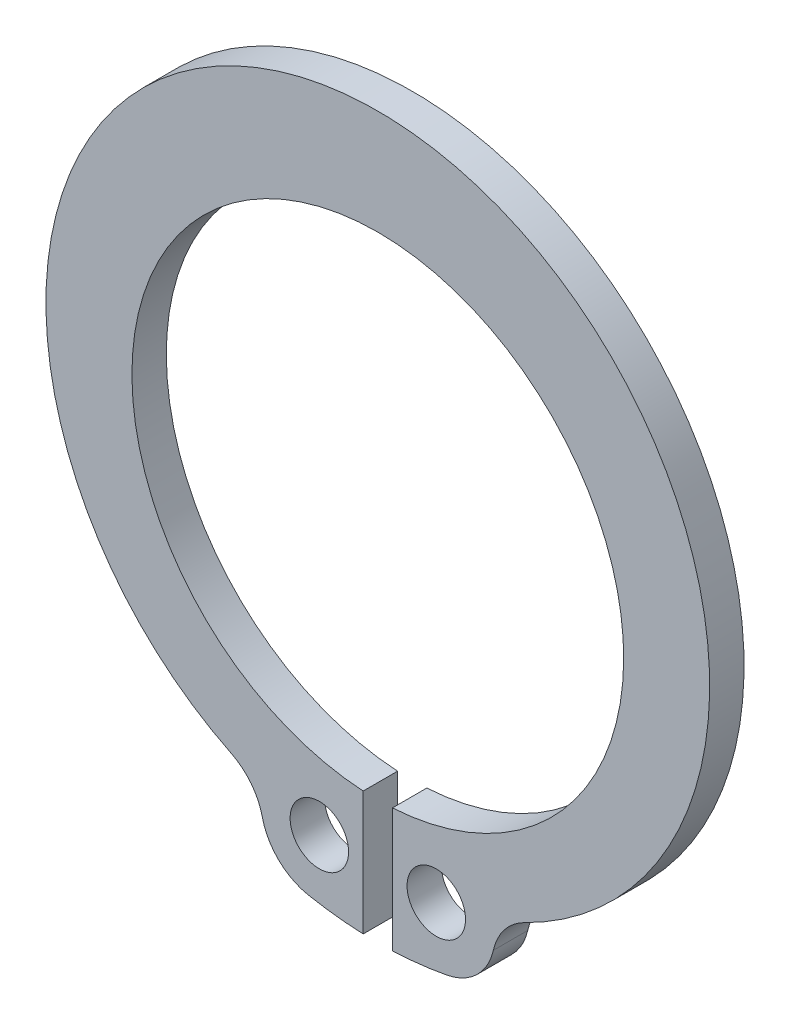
ISO-10303-21;
HEADER;
FILE_DESCRIPTION(('STEP AP214'),'2;1');
FILE_NAME('part.step','',(''),(''),'','','');
FILE_SCHEMA(('AUTOMOTIVE_DESIGN { 1 0 10303 214 1 1 1 1 }'));
ENDSEC;
DATA;
#1=APPLICATION_CONTEXT('core data for automotive mechanical design processes');
#2=APPLICATION_PROTOCOL_DEFINITION('international standard','automotive_design',2000,#1);
#3=PRODUCT_CONTEXT('',#1,'mechanical');
#4=PRODUCT('Part','Part','',(#3));
#5=PRODUCT_RELATED_PRODUCT_CATEGORY('part','',(#4));
#6=PRODUCT_DEFINITION_FORMATION('','',#4);
#7=PRODUCT_DEFINITION_CONTEXT('part definition',#1,'design');
#8=PRODUCT_DEFINITION('design','',#6,#7);
#9=PRODUCT_DEFINITION_SHAPE('','',#8);
#10=(LENGTH_UNIT() NAMED_UNIT(*) SI_UNIT(.MILLI.,.METRE.));
#11=(NAMED_UNIT(*) PLANE_ANGLE_UNIT() SI_UNIT($,.RADIAN.));
#12=(NAMED_UNIT(*) SI_UNIT($,.STERADIAN.) SOLID_ANGLE_UNIT());
#13=UNCERTAINTY_MEASURE_WITH_UNIT(LENGTH_MEASURE(1.E-05),#10,'distance_accuracy_value','');
#14=(GEOMETRIC_REPRESENTATION_CONTEXT(3) GLOBAL_UNCERTAINTY_ASSIGNED_CONTEXT((#13)) GLOBAL_UNIT_ASSIGNED_CONTEXT((#10,
#11,#12)) REPRESENTATION_CONTEXT('',''));
#15=CARTESIAN_POINT('',(0.,0.,0.));
#16=DIRECTION('',(0.,0.,1.));
#17=DIRECTION('',(1.,0.,0.));
#18=AXIS2_PLACEMENT_3D('',#15,#16,#17);
#19=CARTESIAN_POINT('',(0.,-9.11937544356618,1.));
#20=DIRECTION('',(0.,0.,1.));
#21=DIRECTION('',(1.,0.,0.));
#22=AXIS2_PLACEMENT_3D('',#19,#20,#21);
#23=PLANE('',#22);
#24=CARTESIAN_POINT('',(0.,-7.45,1.));
#25=DIRECTION('',(0.,0.,1.));
#26=DIRECTION('',(1.,0.,0.));
#27=AXIS2_PLACEMENT_3D('',#24,#25,#26);
#28=CIRCLE('',#27,9.64999999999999);
#29=CARTESIAN_POINT('',(-4.26561529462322,-16.1060398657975,1.));
#30=VERTEX_POINT('',#29);
#31=CARTESIAN_POINT('',(4.26561529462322,-16.1060398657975,1.));
#32=VERTEX_POINT('',#31);
#33=EDGE_CURVE('E127',#30,#32,#28,.F.);
#34=ORIENTED_EDGE('',*,*,#33,.F.);
#35=CARTESIAN_POINT('',(-5.01707083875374,-17.6309380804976,1.));
#36=DIRECTION('',(0.,0.,1.));
#37=DIRECTION('',(1.,0.,0.));
#38=AXIS2_PLACEMENT_3D('',#35,#36,#37);
#39=CIRCLE('',#38,1.7);
#40=CARTESIAN_POINT('',(-3.35853541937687,-17.2577621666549,1.));
#41=VERTEX_POINT('',#40);
#42=EDGE_CURVE('E124',#41,#30,#39,.T.);
#43=ORIENTED_EDGE('',*,*,#42,.F.);
#44=CARTESIAN_POINT('',(-1.7,-16.8845862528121,1.));
#45=DIRECTION('',(0.,0.,1.));
#46=DIRECTION('',(1.,0.,0.));
#47=AXIS2_PLACEMENT_3D('',#44,#45,#46);
#48=CIRCLE('',#47,1.7);
#49=CARTESIAN_POINT('',(-2.01948650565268,-18.5542953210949,1.));
#50=VERTEX_POINT('',#49);
#51=EDGE_CURVE('E100',#50,#41,#48,.F.);
#52=ORIENTED_EDGE('',*,*,#51,.F.);
#53=CARTESIAN_POINT('',(0.,-8.,1.));
#54=DIRECTION('',(0.,0.,1.));
#55=DIRECTION('',(1.,0.,0.));
#56=AXIS2_PLACEMENT_3D('',#53,#54,#55);
#57=CIRCLE('',#56,10.7457654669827);
#58=CARTESIAN_POINT('',(-0.425000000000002,-18.7373577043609,1.));
#59=VERTEX_POINT('',#58);
#60=EDGE_CURVE('E21',#50,#59,#57,.T.);
#61=ORIENTED_EDGE('',*,*,#60,.T.);
#62=DIRECTION('',(0.,1.,0.));
#63=VECTOR('',#62,1.);
#64=CARTESIAN_POINT('',(-0.424999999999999,-15.1373577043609,1.));
#65=LINE('',#64,#63);
#66=CARTESIAN_POINT('',(-0.424999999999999,-15.1373577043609,1.));
#67=VERTEX_POINT('',#66);
#68=EDGE_CURVE('E97',#67,#59,#65,.F.);
#69=ORIENTED_EDGE('',*,*,#68,.F.);
#70=CARTESIAN_POINT('',(0.,-8.,1.));
#71=DIRECTION('',(0.,0.,1.));
#72=DIRECTION('',(1.,0.,0.));
#73=AXIS2_PLACEMENT_3D('',#70,#71,#72);
#74=CIRCLE('',#73,7.15);
#75=CARTESIAN_POINT('',(0.424999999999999,-15.1373577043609,1.));
#76=VERTEX_POINT('',#75);
#77=EDGE_CURVE('E108',#76,#67,#74,.T.);
#78=ORIENTED_EDGE('',*,*,#77,.F.);
#79=DIRECTION('',(0.,-1.,0.));
#80=VECTOR('',#79,1.);
#81=CARTESIAN_POINT('',(0.424999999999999,-18.7373577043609,1.));
#82=LINE('',#81,#80);
#83=CARTESIAN_POINT('',(0.425,-18.7373577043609,1.));
#84=VERTEX_POINT('',#83);
#85=EDGE_CURVE('E139',#84,#76,#82,.F.);
#86=ORIENTED_EDGE('',*,*,#85,.F.);
#87=CARTESIAN_POINT('',(0.,-8.,1.));
#88=DIRECTION('',(0.,0.,1.));
#89=DIRECTION('',(1.,0.,0.));
#90=AXIS2_PLACEMENT_3D('',#87,#88,#89);
#91=CIRCLE('',#90,10.7457654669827);
#92=CARTESIAN_POINT('',(2.01948650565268,-18.5542953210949,1.));
#93=VERTEX_POINT('',#92);
#94=EDGE_CURVE('E136',#93,#84,#91,.F.);
#95=ORIENTED_EDGE('',*,*,#94,.F.);
#96=CARTESIAN_POINT('',(1.7,-16.8845862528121,1.));
#97=DIRECTION('',(0.,0.,1.));
#98=DIRECTION('',(1.,0.,0.));
#99=AXIS2_PLACEMENT_3D('',#96,#97,#98);
#100=CIRCLE('',#99,1.7);
#101=CARTESIAN_POINT('',(3.35853541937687,-17.2577621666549,1.));
#102=VERTEX_POINT('',#101);
#103=EDGE_CURVE('E133',#102,#93,#100,.F.);
#104=ORIENTED_EDGE('',*,*,#103,.F.);
#105=CARTESIAN_POINT('',(5.01707083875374,-17.6309380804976,1.));
#106=DIRECTION('',(0.,0.,1.));
#107=DIRECTION('',(1.,0.,0.));
#108=AXIS2_PLACEMENT_3D('',#105,#106,#107);
#109=CIRCLE('',#108,1.7);
#110=EDGE_CURVE('E130',#32,#102,#109,.T.);
#111=ORIENTED_EDGE('',*,*,#110,.F.);
#112=EDGE_LOOP('',(#34,#43,#52,#61,#69,#78,#86,#95,#104,#111));
#113=FACE_BOUND('',#112,.T.);
#114=CARTESIAN_POINT('',(-1.7,-16.8845862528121,1.));
#115=DIRECTION('',(0.,0.,1.));
#116=DIRECTION('',(1.,0.,0.));
#117=AXIS2_PLACEMENT_3D('',#114,#115,#116);
#118=CIRCLE('',#117,0.85);
#119=CARTESIAN_POINT('',(-0.849999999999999,-16.8845862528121,1.));
#120=VERTEX_POINT('',#119);
#121=EDGE_CURVE('E109',#120,#120,#118,.F.);
#122=ORIENTED_EDGE('',*,*,#121,.T.);
#123=EDGE_LOOP('',(#122));
#124=FACE_BOUND('',#123,.T.);
#125=CARTESIAN_POINT('',(1.7,-16.8845862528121,1.));
#126=DIRECTION('',(0.,0.,1.));
#127=DIRECTION('',(1.,0.,0.));
#128=AXIS2_PLACEMENT_3D('',#125,#126,#127);
#129=CIRCLE('',#128,0.85);
#130=CARTESIAN_POINT('',(2.55,-16.8845862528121,1.));
#131=VERTEX_POINT('',#130);
#132=EDGE_CURVE('E101',#131,#131,#129,.F.);
#133=ORIENTED_EDGE('',*,*,#132,.T.);
#134=EDGE_LOOP('',(#133));
#135=FACE_BOUND('',#134,.T.);
#136=ADVANCED_FACE('F17',(#113,#124,#135),#23,.T.);
#137=CARTESIAN_POINT('',(1.7,-16.8845862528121,0.));
#138=DIRECTION('',(0.,0.,1.));
#139=DIRECTION('',(1.,0.,0.));
#140=AXIS2_PLACEMENT_3D('',#137,#138,#139);
#141=CYLINDRICAL_SURFACE('',#140,0.85);
#142=CARTESIAN_POINT('',(1.7,-16.8845862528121,0.));
#143=DIRECTION('',(0.,0.,1.));
#144=DIRECTION('',(1.,0.,0.));
#145=AXIS2_PLACEMENT_3D('',#142,#143,#144);
#146=CIRCLE('',#145,0.85);
#147=CARTESIAN_POINT('',(2.55,-16.8845862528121,0.));
#148=VERTEX_POINT('',#147);
#149=EDGE_CURVE('E112',#148,#148,#146,.F.);
#150=ORIENTED_EDGE('',*,*,#149,.T.);
#151=EDGE_LOOP('',(#150));
#152=FACE_BOUND('',#151,.T.);
#153=ORIENTED_EDGE('',*,*,#132,.F.);
#154=EDGE_LOOP('',(#153));
#155=FACE_BOUND('',#154,.T.);
#156=ADVANCED_FACE('F178',(#152,#155),#141,.F.);
#157=CARTESIAN_POINT('',(-1.7,-16.8845862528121,0.));
#158=DIRECTION('',(0.,0.,1.));
#159=DIRECTION('',(1.,0.,0.));
#160=AXIS2_PLACEMENT_3D('',#157,#158,#159);
#161=CYLINDRICAL_SURFACE('',#160,0.85);
#162=CARTESIAN_POINT('',(-1.7,-16.8845862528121,0.));
#163=DIRECTION('',(0.,0.,1.));
#164=DIRECTION('',(1.,0.,0.));
#165=AXIS2_PLACEMENT_3D('',#162,#163,#164);
#166=CIRCLE('',#165,0.85);
#167=CARTESIAN_POINT('',(-0.849999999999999,-16.8845862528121,0.));
#168=VERTEX_POINT('',#167);
#169=EDGE_CURVE('E115',#168,#168,#166,.F.);
#170=ORIENTED_EDGE('',*,*,#169,.T.);
#171=EDGE_LOOP('',(#170));
#172=FACE_BOUND('',#171,.T.);
#173=ORIENTED_EDGE('',*,*,#121,.F.);
#174=EDGE_LOOP('',(#173));
#175=FACE_BOUND('',#174,.T.);
#176=ADVANCED_FACE('F180',(#172,#175),#161,.F.);
#177=CARTESIAN_POINT('',(-0.424999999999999,-15.1373577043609,0.));
#178=DIRECTION('',(1.,0.,0.));
#179=DIRECTION('',(0.,0.,-1.));
#180=AXIS2_PLACEMENT_3D('',#177,#178,#179);
#181=PLANE('',#180);
#182=DIRECTION('',(0.,1.,0.));
#183=VECTOR('',#182,1.);
#184=CARTESIAN_POINT('',(-0.424999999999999,-9.11937544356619,0.));
#185=LINE('',#184,#183);
#186=CARTESIAN_POINT('',(-0.425000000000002,-18.7373577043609,0.));
#187=VERTEX_POINT('',#186);
#188=CARTESIAN_POINT('',(-0.424999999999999,-15.1373577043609,0.));
#189=VERTEX_POINT('',#188);
#190=EDGE_CURVE('E163',#187,#189,#185,.T.);
#191=ORIENTED_EDGE('',*,*,#190,.T.);
#192=DIRECTION('',(0.,0.,1.));
#193=VECTOR('',#192,1.);
#194=CARTESIAN_POINT('',(-0.424999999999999,-15.1373577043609,0.));
#195=LINE('',#194,#193);
#196=EDGE_CURVE('E107',#67,#189,#195,.F.);
#197=ORIENTED_EDGE('',*,*,#196,.F.);
#198=ORIENTED_EDGE('',*,*,#68,.T.);
#199=DIRECTION('',(0.,0.,1.));
#200=VECTOR('',#199,1.);
#201=CARTESIAN_POINT('',(-0.425000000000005,-18.7373577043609,0.));
#202=LINE('',#201,#200);
#203=EDGE_CURVE('E106',#187,#59,#202,.T.);
#204=ORIENTED_EDGE('',*,*,#203,.F.);
#205=EDGE_LOOP('',(#191,#197,#198,#204));
#206=FACE_BOUND('',#205,.T.);
#207=ADVANCED_FACE('F105',(#206),#181,.T.);
#208=CARTESIAN_POINT('',(0.,-8.,0.));
#209=DIRECTION('',(0.,0.,1.));
#210=DIRECTION('',(1.,0.,0.));
#211=AXIS2_PLACEMENT_3D('',#208,#209,#210);
#212=CYLINDRICAL_SURFACE('',#211,7.15);
#213=CARTESIAN_POINT('',(0.,-8.,0.));
#214=DIRECTION('',(0.,0.,1.));
#215=DIRECTION('',(1.,0.,0.));
#216=AXIS2_PLACEMENT_3D('',#213,#214,#215);
#217=CIRCLE('',#216,7.15);
#218=CARTESIAN_POINT('',(0.424999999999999,-15.1373577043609,0.));
#219=VERTEX_POINT('',#218);
#220=EDGE_CURVE('E160',#189,#219,#217,.F.);
#221=ORIENTED_EDGE('',*,*,#220,.T.);
#222=DIRECTION('',(0.,0.,1.));
#223=VECTOR('',#222,1.);
#224=CARTESIAN_POINT('',(0.424999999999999,-15.1373577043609,0.));
#225=LINE('',#224,#223);
#226=EDGE_CURVE('E137',#76,#219,#225,.F.);
#227=ORIENTED_EDGE('',*,*,#226,.F.);
#228=ORIENTED_EDGE('',*,*,#77,.T.);
#229=ORIENTED_EDGE('',*,*,#196,.T.);
#230=EDGE_LOOP('',(#221,#227,#228,#229));
#231=FACE_BOUND('',#230,.T.);
#232=ADVANCED_FACE('F238',(#231),#212,.F.);
#233=CARTESIAN_POINT('',(0.424999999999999,-18.7373577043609,0.));
#234=DIRECTION('',(-1.,0.,0.));
#235=DIRECTION('',(0.,-1.,0.));
#236=AXIS2_PLACEMENT_3D('',#233,#234,#235);
#237=PLANE('',#236);
#238=DIRECTION('',(0.,1.,0.));
#239=VECTOR('',#238,1.);
#240=CARTESIAN_POINT('',(0.424999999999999,-9.11937544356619,0.));
#241=LINE('',#240,#239);
#242=CARTESIAN_POINT('',(0.425,-18.7373577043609,0.));
#243=VERTEX_POINT('',#242);
#244=EDGE_CURVE('E159',#219,#243,#241,.F.);
#245=ORIENTED_EDGE('',*,*,#244,.T.);
#246=DIRECTION('',(0.,0.,1.));
#247=VECTOR('',#246,1.);
#248=CARTESIAN_POINT('',(0.425000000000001,-18.7373577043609,0.));
#249=LINE('',#248,#247);
#250=EDGE_CURVE('E134',#84,#243,#249,.F.);
#251=ORIENTED_EDGE('',*,*,#250,.F.);
#252=ORIENTED_EDGE('',*,*,#85,.T.);
#253=ORIENTED_EDGE('',*,*,#226,.T.);
#254=EDGE_LOOP('',(#245,#251,#252,#253));
#255=FACE_BOUND('',#254,.T.);
#256=ADVANCED_FACE('F233',(#255),#237,.T.);
#257=CARTESIAN_POINT('',(0.,-8.,0.));
#258=DIRECTION('',(0.,0.,1.));
#259=DIRECTION('',(1.,0.,0.));
#260=AXIS2_PLACEMENT_3D('',#257,#258,#259);
#261=CYLINDRICAL_SURFACE('',#260,10.7457654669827);
#262=CARTESIAN_POINT('',(0.,-8.,0.));
#263=DIRECTION('',(0.,0.,1.));
#264=DIRECTION('',(1.,0.,0.));
#265=AXIS2_PLACEMENT_3D('',#262,#263,#264);
#266=CIRCLE('',#265,10.7457654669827);
#267=CARTESIAN_POINT('',(2.01948650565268,-18.5542953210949,0.));
#268=VERTEX_POINT('',#267);
#269=EDGE_CURVE('E156',#243,#268,#266,.T.);
#270=ORIENTED_EDGE('',*,*,#269,.T.);
#271=DIRECTION('',(0.,0.,1.));
#272=VECTOR('',#271,1.);
#273=CARTESIAN_POINT('',(2.01948650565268,-18.5542953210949,0.));
#274=LINE('',#273,#272);
#275=EDGE_CURVE('E131',#93,#268,#274,.F.);
#276=ORIENTED_EDGE('',*,*,#275,.F.);
#277=ORIENTED_EDGE('',*,*,#94,.T.);
#278=ORIENTED_EDGE('',*,*,#250,.T.);
#279=EDGE_LOOP('',(#270,#276,#277,#278));
#280=FACE_BOUND('',#279,.T.);
#281=ADVANCED_FACE('F229',(#280),#261,.T.);
#282=CARTESIAN_POINT('',(1.7,-16.8845862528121,0.));
#283=DIRECTION('',(0.,0.,1.));
#284=DIRECTION('',(1.,0.,0.));
#285=AXIS2_PLACEMENT_3D('',#282,#283,#284);
#286=CYLINDRICAL_SURFACE('',#285,1.7);
#287=CARTESIAN_POINT('',(1.7,-16.8845862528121,0.));
#288=DIRECTION('',(0.,0.,1.));
#289=DIRECTION('',(1.,0.,0.));
#290=AXIS2_PLACEMENT_3D('',#287,#288,#289);
#291=CIRCLE('',#290,1.7);
#292=CARTESIAN_POINT('',(3.35853541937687,-17.2577621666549,0.));
#293=VERTEX_POINT('',#292);
#294=EDGE_CURVE('E153',#268,#293,#291,.T.);
#295=ORIENTED_EDGE('',*,*,#294,.T.);
#296=DIRECTION('',(0.,0.,1.));
#297=VECTOR('',#296,1.);
#298=CARTESIAN_POINT('',(3.35853541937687,-17.2577621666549,0.));
#299=LINE('',#298,#297);
#300=EDGE_CURVE('E128',#102,#293,#299,.F.);
#301=ORIENTED_EDGE('',*,*,#300,.F.);
#302=ORIENTED_EDGE('',*,*,#103,.T.);
#303=ORIENTED_EDGE('',*,*,#275,.T.);
#304=EDGE_LOOP('',(#295,#301,#302,#303));
#305=FACE_BOUND('',#304,.T.);
#306=ADVANCED_FACE('F222',(#305),#286,.T.);
#307=CARTESIAN_POINT('',(5.01707083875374,-17.6309380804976,0.));
#308=DIRECTION('',(0.,0.,1.));
#309=DIRECTION('',(1.,0.,0.));
#310=AXIS2_PLACEMENT_3D('',#307,#308,#309);
#311=CYLINDRICAL_SURFACE('',#310,1.7);
#312=CARTESIAN_POINT('',(5.01707083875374,-17.6309380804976,0.));
#313=DIRECTION('',(0.,0.,1.));
#314=DIRECTION('',(1.,0.,0.));
#315=AXIS2_PLACEMENT_3D('',#312,#313,#314);
#316=CIRCLE('',#315,1.7);
#317=CARTESIAN_POINT('',(4.26561529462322,-16.1060398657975,0.));
#318=VERTEX_POINT('',#317);
#319=EDGE_CURVE('E150',#293,#318,#316,.F.);
#320=ORIENTED_EDGE('',*,*,#319,.T.);
#321=DIRECTION('',(0.,0.,1.));
#322=VECTOR('',#321,1.);
#323=CARTESIAN_POINT('',(4.26561529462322,-16.1060398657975,0.));
#324=LINE('',#323,#322);
#325=EDGE_CURVE('E125',#32,#318,#324,.F.);
#326=ORIENTED_EDGE('',*,*,#325,.F.);
#327=ORIENTED_EDGE('',*,*,#110,.T.);
#328=ORIENTED_EDGE('',*,*,#300,.T.);
#329=EDGE_LOOP('',(#320,#326,#327,#328));
#330=FACE_BOUND('',#329,.T.);
#331=ADVANCED_FACE('F218',(#330),#311,.F.);
#332=CARTESIAN_POINT('',(0.,-7.45,0.));
#333=DIRECTION('',(0.,0.,1.));
#334=DIRECTION('',(1.,0.,0.));
#335=AXIS2_PLACEMENT_3D('',#332,#333,#334);
#336=CYLINDRICAL_SURFACE('',#335,9.64999999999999);
#337=CARTESIAN_POINT('',(0.,-7.45,0.));
#338=DIRECTION('',(0.,0.,1.));
#339=DIRECTION('',(1.,0.,0.));
#340=AXIS2_PLACEMENT_3D('',#337,#338,#339);
#341=CIRCLE('',#340,9.64999999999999);
#342=CARTESIAN_POINT('',(-4.26561529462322,-16.1060398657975,0.));
#343=VERTEX_POINT('',#342);
#344=EDGE_CURVE('E147',#318,#343,#341,.T.);
#345=ORIENTED_EDGE('',*,*,#344,.T.);
#346=DIRECTION('',(0.,0.,1.));
#347=VECTOR('',#346,1.);
#348=CARTESIAN_POINT('',(-4.26561529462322,-16.1060398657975,0.));
#349=LINE('',#348,#347);
#350=EDGE_CURVE('E122',#30,#343,#349,.F.);
#351=ORIENTED_EDGE('',*,*,#350,.F.);
#352=ORIENTED_EDGE('',*,*,#33,.T.);
#353=ORIENTED_EDGE('',*,*,#325,.T.);
#354=EDGE_LOOP('',(#345,#351,#352,#353));
#355=FACE_BOUND('',#354,.T.);
#356=ADVANCED_FACE('F212',(#355),#336,.T.);
#357=CARTESIAN_POINT('',(-5.01707083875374,-17.6309380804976,0.));
#358=DIRECTION('',(0.,0.,1.));
#359=DIRECTION('',(1.,0.,0.));
#360=AXIS2_PLACEMENT_3D('',#357,#358,#359);
#361=CYLINDRICAL_SURFACE('',#360,1.7);
#362=CARTESIAN_POINT('',(-5.01707083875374,-17.6309380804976,0.));
#363=DIRECTION('',(0.,0.,1.));
#364=DIRECTION('',(1.,0.,0.));
#365=AXIS2_PLACEMENT_3D('',#362,#363,#364);
#366=CIRCLE('',#365,1.7);
#367=CARTESIAN_POINT('',(-3.35853541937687,-17.2577621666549,0.));
#368=VERTEX_POINT('',#367);
#369=EDGE_CURVE('E144',#343,#368,#366,.F.);
#370=ORIENTED_EDGE('',*,*,#369,.T.);
#371=DIRECTION('',(0.,0.,1.));
#372=VECTOR('',#371,1.);
#373=CARTESIAN_POINT('',(-3.35853541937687,-17.2577621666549,0.));
#374=LINE('',#373,#372);
#375=EDGE_CURVE('E117',#41,#368,#374,.F.);
#376=ORIENTED_EDGE('',*,*,#375,.F.);
#377=ORIENTED_EDGE('',*,*,#42,.T.);
#378=ORIENTED_EDGE('',*,*,#350,.T.);
#379=EDGE_LOOP('',(#370,#376,#377,#378));
#380=FACE_BOUND('',#379,.T.);
#381=ADVANCED_FACE('F209',(#380),#361,.F.);
#382=CARTESIAN_POINT('',(-1.7,-16.8845862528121,0.));
#383=DIRECTION('',(0.,0.,1.));
#384=DIRECTION('',(1.,0.,0.));
#385=AXIS2_PLACEMENT_3D('',#382,#383,#384);
#386=CYLINDRICAL_SURFACE('',#385,1.7);
#387=CARTESIAN_POINT('',(-1.7,-16.8845862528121,0.));
#388=DIRECTION('',(0.,0.,1.));
#389=DIRECTION('',(1.,0.,0.));
#390=AXIS2_PLACEMENT_3D('',#387,#388,#389);
#391=CIRCLE('',#390,1.7);
#392=CARTESIAN_POINT('',(-2.01948650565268,-18.5542953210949,0.));
#393=VERTEX_POINT('',#392);
#394=EDGE_CURVE('E27',#368,#393,#391,.T.);
#395=ORIENTED_EDGE('',*,*,#394,.T.);
#396=DIRECTION('',(0.,0.,1.));
#397=VECTOR('',#396,1.);
#398=CARTESIAN_POINT('',(-2.01948650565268,-18.5542953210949,0.));
#399=LINE('',#398,#397);
#400=EDGE_CURVE('E35',#50,#393,#399,.F.);
#401=ORIENTED_EDGE('',*,*,#400,.F.);
#402=ORIENTED_EDGE('',*,*,#51,.T.);
#403=ORIENTED_EDGE('',*,*,#375,.T.);
#404=EDGE_LOOP('',(#395,#401,#402,#403));
#405=FACE_BOUND('',#404,.T.);
#406=ADVANCED_FACE('F196',(#405),#386,.T.);
#407=CARTESIAN_POINT('',(0.,-8.,0.));
#408=DIRECTION('',(0.,0.,1.));
#409=DIRECTION('',(1.,0.,0.));
#410=AXIS2_PLACEMENT_3D('',#407,#408,#409);
#411=CYLINDRICAL_SURFACE('',#410,10.7457654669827);
#412=CARTESIAN_POINT('',(0.,-8.,0.));
#413=DIRECTION('',(0.,0.,1.));
#414=DIRECTION('',(1.,0.,0.));
#415=AXIS2_PLACEMENT_3D('',#412,#413,#414);
#416=CIRCLE('',#415,10.7457654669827);
#417=EDGE_CURVE('E11',#393,#187,#416,.T.);
#418=ORIENTED_EDGE('',*,*,#417,.T.);
#419=ORIENTED_EDGE('',*,*,#203,.T.);
#420=ORIENTED_EDGE('',*,*,#60,.F.);
#421=ORIENTED_EDGE('',*,*,#400,.T.);
#422=EDGE_LOOP('',(#418,#419,#420,#421));
#423=FACE_BOUND('',#422,.T.);
#424=ADVANCED_FACE('F111',(#423),#411,.T.);
#425=CARTESIAN_POINT('',(0.,-9.11937544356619,0.));
#426=DIRECTION('',(0.,0.,1.));
#427=DIRECTION('',(1.,0.,0.));
#428=AXIS2_PLACEMENT_3D('',#425,#426,#427);
#429=PLANE('',#428);
#430=ORIENTED_EDGE('',*,*,#394,.F.);
#431=ORIENTED_EDGE('',*,*,#369,.F.);
#432=ORIENTED_EDGE('',*,*,#344,.F.);
#433=ORIENTED_EDGE('',*,*,#319,.F.);
#434=ORIENTED_EDGE('',*,*,#294,.F.);
#435=ORIENTED_EDGE('',*,*,#269,.F.);
#436=ORIENTED_EDGE('',*,*,#244,.F.);
#437=ORIENTED_EDGE('',*,*,#220,.F.);
#438=ORIENTED_EDGE('',*,*,#190,.F.);
#439=ORIENTED_EDGE('',*,*,#417,.F.);
#440=EDGE_LOOP('',(#430,#431,#432,#433,#434,#435,#436,#437,#438,#439));
#441=FACE_BOUND('',#440,.T.);
#442=ORIENTED_EDGE('',*,*,#169,.F.);
#443=EDGE_LOOP('',(#442));
#444=FACE_BOUND('',#443,.T.);
#445=ORIENTED_EDGE('',*,*,#149,.F.);
#446=EDGE_LOOP('',(#445));
#447=FACE_BOUND('',#446,.T.);
#448=ADVANCED_FACE('F19',(#441,#444,#447),#429,.F.);
#449=CLOSED_SHELL('',(#136,#156,#176,#207,#232,#256,#281,#306,#331,#356,#381,#406,#424,#448));
#450=MANIFOLD_SOLID_BREP('B1',#449);
#451=ADVANCED_BREP_SHAPE_REPRESENTATION('',(#18,#450),#14);
#452=SHAPE_DEFINITION_REPRESENTATION(#9,#451);
ENDSEC;
END-ISO-10303-21;
